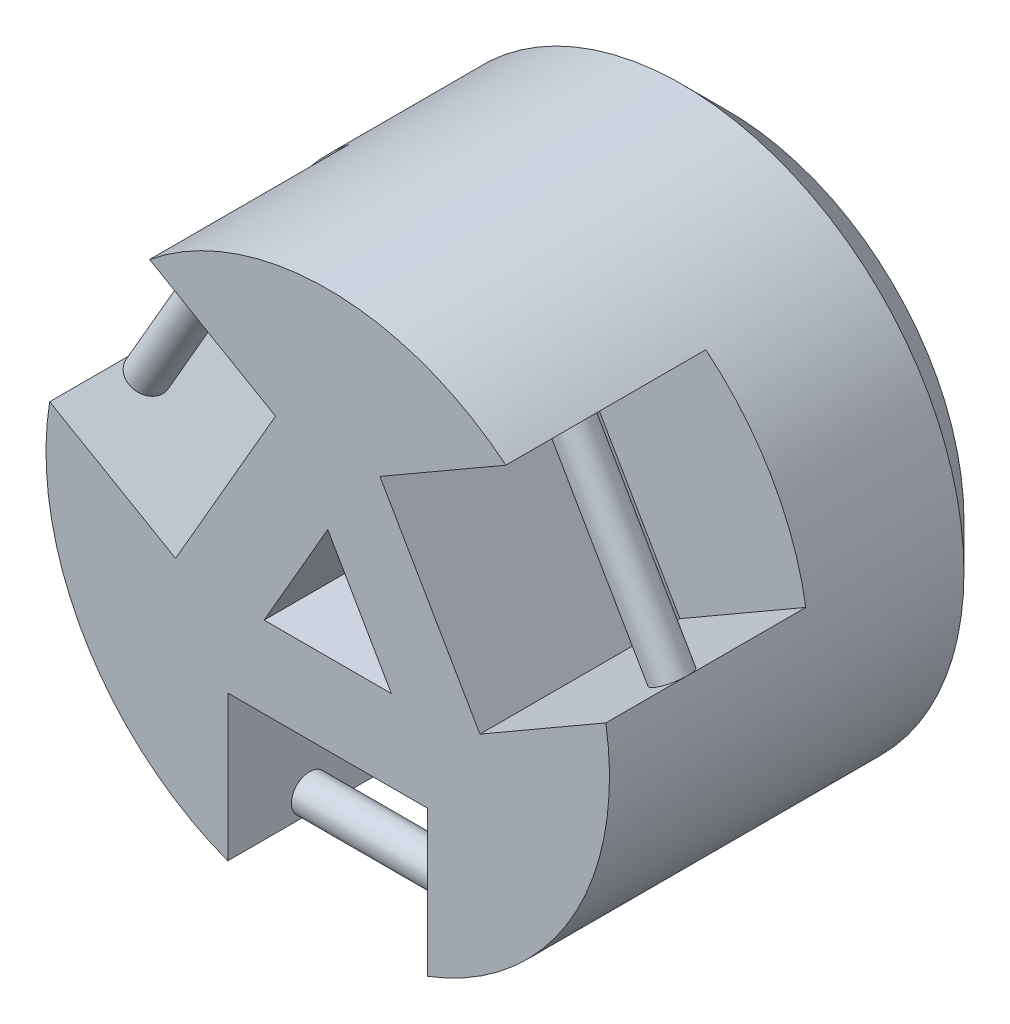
ISO-10303-21;
HEADER;
FILE_DESCRIPTION(('STEP AP214'),'2;1');
FILE_NAME('part.step','',(''),(''),'','','');
FILE_SCHEMA(('AUTOMOTIVE_DESIGN { 1 0 10303 214 1 1 1 1 }'));
ENDSEC;
DATA;
#1=APPLICATION_CONTEXT('core data for automotive mechanical design processes');
#2=APPLICATION_PROTOCOL_DEFINITION('international standard','automotive_design',2000,#1);
#3=PRODUCT_CONTEXT('',#1,'mechanical');
#4=PRODUCT('Part','Part','',(#3));
#5=PRODUCT_RELATED_PRODUCT_CATEGORY('part','',(#4));
#6=PRODUCT_DEFINITION_FORMATION('','',#4);
#7=PRODUCT_DEFINITION_CONTEXT('part definition',#1,'design');
#8=PRODUCT_DEFINITION('design','',#6,#7);
#9=PRODUCT_DEFINITION_SHAPE('','',#8);
#10=(LENGTH_UNIT() NAMED_UNIT(*) SI_UNIT(.MILLI.,.METRE.));
#11=(NAMED_UNIT(*) PLANE_ANGLE_UNIT() SI_UNIT($,.RADIAN.));
#12=(NAMED_UNIT(*) SI_UNIT($,.STERADIAN.) SOLID_ANGLE_UNIT());
#13=UNCERTAINTY_MEASURE_WITH_UNIT(LENGTH_MEASURE(1.E-05),#10,'distance_accuracy_value','');
#14=(GEOMETRIC_REPRESENTATION_CONTEXT(3) GLOBAL_UNCERTAINTY_ASSIGNED_CONTEXT((#13)) GLOBAL_UNIT_ASSIGNED_CONTEXT((#10,
#11,#12)) REPRESENTATION_CONTEXT('',''));
#15=CARTESIAN_POINT('',(0.,0.,0.));
#16=DIRECTION('',(0.,0.,1.));
#17=DIRECTION('',(1.,0.,0.));
#18=AXIS2_PLACEMENT_3D('',#15,#16,#17);
#19=CARTESIAN_POINT('',(0.,0.,22.));
#20=DIRECTION('',(0.,0.,-1.));
#21=DIRECTION('',(-1.,0.,0.));
#22=AXIS2_PLACEMENT_3D('',#19,#20,#21);
#23=CYLINDRICAL_SURFACE('',#22,15.5);
#24=CARTESIAN_POINT('',(0.,0.,2.5));
#25=DIRECTION('',(0.,0.,1.));
#26=DIRECTION('',(1.,0.,0.));
#27=AXIS2_PLACEMENT_3D('',#24,#25,#26);
#28=CIRCLE('',#27,15.5);
#29=CARTESIAN_POINT('',(15.5,0.,2.5));
#30=VERTEX_POINT('',#29);
#31=EDGE_CURVE('E235',#30,#30,#28,.T.);
#32=ORIENTED_EDGE('',*,*,#31,.T.);
#33=EDGE_LOOP('',(#32));
#34=FACE_BOUND('',#33,.T.);
#35=CARTESIAN_POINT('',(0.,0.,11.));
#36=DIRECTION('',(0.,0.,1.));
#37=DIRECTION('',(-0.499999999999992,0.866025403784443,0.));
#38=AXIS2_PLACEMENT_3D('',#35,#36,#37);
#39=CIRCLE('',#38,15.5);
#40=CARTESIAN_POINT('',(15.2999003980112,2.48254865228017,11.));
#41=VERTEX_POINT('',#40);
#42=CARTESIAN_POINT('',(9.79990039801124,12.008828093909,11.));
#43=VERTEX_POINT('',#42);
#44=EDGE_CURVE('E535',#41,#43,#39,.T.);
#45=ORIENTED_EDGE('',*,*,#44,.F.);
#46=DIRECTION('',(0.,0.,1.));
#47=VECTOR('',#46,1.);
#48=CARTESIAN_POINT('',(15.2999003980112,2.48254865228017,11.));
#49=LINE('',#48,#47);
#50=CARTESIAN_POINT('',(15.2999003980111,2.48254865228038,17.5));
#51=VERTEX_POINT('',#50);
#52=EDGE_CURVE('E554',#41,#51,#49,.T.);
#53=ORIENTED_EDGE('',*,*,#52,.T.);
#54=CARTESIAN_POINT('',(15.2999003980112,2.48254865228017,22.));
#55=VERTEX_POINT('',#54);
#56=EDGE_CURVE('E557',#51,#55,#49,.T.);
#57=ORIENTED_EDGE('',*,*,#56,.T.);
#58=CARTESIAN_POINT('',(0.,0.,22.));
#59=DIRECTION('',(0.,0.,1.));
#60=DIRECTION('',(1.,0.,0.));
#61=AXIS2_PLACEMENT_3D('',#58,#59,#60);
#62=CIRCLE('',#61,15.5);
#63=CARTESIAN_POINT('',(5.5,-14.4913767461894,22.));
#64=VERTEX_POINT('',#63);
#65=EDGE_CURVE('E232',#64,#55,#62,.T.);
#66=ORIENTED_EDGE('',*,*,#65,.F.);
#67=DIRECTION('',(0.,0.,1.));
#68=VECTOR('',#67,1.);
#69=CARTESIAN_POINT('',(5.5,-14.4913767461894,11.));
#70=LINE('',#69,#68);
#71=CARTESIAN_POINT('',(5.5,-14.4913767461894,17.5));
#72=VERTEX_POINT('',#71);
#73=EDGE_CURVE('E213',#72,#64,#70,.T.);
#74=ORIENTED_EDGE('',*,*,#73,.F.);
#75=CARTESIAN_POINT('',(5.5,-14.4913767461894,11.));
#76=VERTEX_POINT('',#75);
#77=EDGE_CURVE('E230',#76,#72,#70,.T.);
#78=ORIENTED_EDGE('',*,*,#77,.F.);
#79=CARTESIAN_POINT('',(0.,0.,11.));
#80=DIRECTION('',(0.,0.,1.));
#81=DIRECTION('',(1.,0.,0.));
#82=AXIS2_PLACEMENT_3D('',#79,#80,#81);
#83=CIRCLE('',#82,15.5);
#84=CARTESIAN_POINT('',(-5.5,-14.4913767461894,11.));
#85=VERTEX_POINT('',#84);
#86=EDGE_CURVE('E200',#85,#76,#83,.T.);
#87=ORIENTED_EDGE('',*,*,#86,.F.);
#88=DIRECTION('',(0.,0.,1.));
#89=VECTOR('',#88,1.);
#90=CARTESIAN_POINT('',(-5.5,-14.4913767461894,11.));
#91=LINE('',#90,#89);
#92=CARTESIAN_POINT('',(-5.5,-14.4913767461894,17.5));
#93=VERTEX_POINT('',#92);
#94=EDGE_CURVE('E223',#85,#93,#91,.T.);
#95=ORIENTED_EDGE('',*,*,#94,.T.);
#96=CARTESIAN_POINT('',(-5.5,-14.4913767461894,22.));
#97=VERTEX_POINT('',#96);
#98=EDGE_CURVE('E225',#93,#97,#91,.T.);
#99=ORIENTED_EDGE('',*,*,#98,.T.);
#100=CARTESIAN_POINT('',(-15.2999003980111,2.48254865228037,22.));
#101=VERTEX_POINT('',#100);
#102=EDGE_CURVE('E190',#101,#97,#62,.T.);
#103=ORIENTED_EDGE('',*,*,#102,.F.);
#104=DIRECTION('',(0.,0.,1.));
#105=VECTOR('',#104,1.);
#106=CARTESIAN_POINT('',(-15.2999003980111,2.48254865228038,11.));
#107=LINE('',#106,#105);
#108=CARTESIAN_POINT('',(-15.2999003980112,2.48254865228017,17.5));
#109=VERTEX_POINT('',#108);
#110=EDGE_CURVE('E185',#109,#101,#107,.T.);
#111=ORIENTED_EDGE('',*,*,#110,.F.);
#112=CARTESIAN_POINT('',(-15.2999003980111,2.48254865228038,11.));
#113=VERTEX_POINT('',#112);
#114=EDGE_CURVE('E174',#113,#109,#107,.T.);
#115=ORIENTED_EDGE('',*,*,#114,.F.);
#116=CARTESIAN_POINT('',(0.,0.,11.));
#117=DIRECTION('',(0.,0.,1.));
#118=DIRECTION('',(-0.500000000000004,-0.866025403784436,0.));
#119=AXIS2_PLACEMENT_3D('',#116,#117,#118);
#120=CIRCLE('',#119,15.5);
#121=CARTESIAN_POINT('',(-9.79990039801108,12.0088280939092,11.));
#122=VERTEX_POINT('',#121);
#123=EDGE_CURVE('E564',#122,#113,#120,.T.);
#124=ORIENTED_EDGE('',*,*,#123,.F.);
#125=DIRECTION('',(0.,0.,1.));
#126=VECTOR('',#125,1.);
#127=CARTESIAN_POINT('',(-9.79990039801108,12.0088280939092,11.));
#128=LINE('',#127,#126);
#129=CARTESIAN_POINT('',(-9.79990039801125,12.008828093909,17.5));
#130=VERTEX_POINT('',#129);
#131=EDGE_CURVE('E218',#122,#130,#128,.T.);
#132=ORIENTED_EDGE('',*,*,#131,.T.);
#133=CARTESIAN_POINT('',(-9.79990039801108,12.0088280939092,22.));
#134=VERTEX_POINT('',#133);
#135=EDGE_CURVE('E576',#130,#134,#128,.T.);
#136=ORIENTED_EDGE('',*,*,#135,.T.);
#137=CARTESIAN_POINT('',(9.79990039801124,12.008828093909,22.));
#138=VERTEX_POINT('',#137);
#139=EDGE_CURVE('E236',#138,#134,#62,.T.);
#140=ORIENTED_EDGE('',*,*,#139,.F.);
#141=DIRECTION('',(0.,0.,1.));
#142=VECTOR('',#141,1.);
#143=CARTESIAN_POINT('',(9.79990039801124,12.008828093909,11.));
#144=LINE('',#143,#142);
#145=CARTESIAN_POINT('',(9.79990039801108,12.0088280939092,17.5));
#146=VERTEX_POINT('',#145);
#147=EDGE_CURVE('E70',#146,#138,#144,.T.);
#148=ORIENTED_EDGE('',*,*,#147,.F.);
#149=EDGE_CURVE('E562',#43,#146,#144,.T.);
#150=ORIENTED_EDGE('',*,*,#149,.F.);
#151=EDGE_LOOP('',(#45,#53,#57,#66,#74,#78,#87,#95,#99,#103,#111,#115,#124,#132,#136,#140,#148,#150));
#152=FACE_BOUND('',#151,.T.);
#153=ADVANCED_FACE('F47',(#34,#152),#23,.T.);
#154=CARTESIAN_POINT('',(0.,0.,22.));
#155=DIRECTION('',(0.,0.,1.));
#156=DIRECTION('',(1.,0.,0.));
#157=AXIS2_PLACEMENT_3D('',#154,#155,#156);
#158=PLANE('',#157);
#159=DIRECTION('',(1.,0.,0.));
#160=VECTOR('',#159,1.);
#161=CARTESIAN_POINT('',(3.5,-2.02072594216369,22.));
#162=LINE('',#161,#160);
#163=CARTESIAN_POINT('',(-3.5,-2.02072594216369,22.));
#164=VERTEX_POINT('',#163);
#165=CARTESIAN_POINT('',(3.5,-2.02072594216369,22.));
#166=VERTEX_POINT('',#165);
#167=EDGE_CURVE('E62',#164,#166,#162,.T.);
#168=ORIENTED_EDGE('',*,*,#167,.F.);
#169=DIRECTION('',(-0.5,-0.866025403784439,0.));
#170=VECTOR('',#169,1.);
#171=CARTESIAN_POINT('',(-3.5,-2.02072594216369,22.));
#172=LINE('',#171,#170);
#173=CARTESIAN_POINT('',(0.,4.04145188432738,22.));
#174=VERTEX_POINT('',#173);
#175=EDGE_CURVE('E516',#174,#164,#172,.T.);
#176=ORIENTED_EDGE('',*,*,#175,.F.);
#177=DIRECTION('',(-0.5,0.866025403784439,0.));
#178=VECTOR('',#177,1.);
#179=CARTESIAN_POINT('',(0.,4.04145188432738,22.));
#180=LINE('',#179,#178);
#181=EDGE_CURVE('E524',#166,#174,#180,.T.);
#182=ORIENTED_EDGE('',*,*,#181,.F.);
#183=EDGE_LOOP('',(#168,#176,#182));
#184=FACE_BOUND('',#183,.T.);
#185=DIRECTION('',(0.866025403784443,0.499999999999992,0.));
#186=VECTOR('',#185,1.);
#187=CARTESIAN_POINT('',(8.37169716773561,-1.51745134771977,22.));
#188=LINE('',#187,#186);
#189=CARTESIAN_POINT('',(8.37169716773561,-1.51745134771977,22.));
#190=VERTEX_POINT('',#189);
#191=EDGE_CURVE('E539',#190,#55,#188,.T.);
#192=ORIENTED_EDGE('',*,*,#191,.F.);
#193=DIRECTION('',(0.499999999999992,-0.866025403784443,0.));
#194=VECTOR('',#193,1.);
#195=CARTESIAN_POINT('',(8.37169716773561,-1.51745134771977,22.));
#196=LINE('',#195,#194);
#197=CARTESIAN_POINT('',(2.8716971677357,8.00882809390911,22.));
#198=VERTEX_POINT('',#197);
#199=EDGE_CURVE('E549',#198,#190,#196,.T.);
#200=ORIENTED_EDGE('',*,*,#199,.F.);
#201=DIRECTION('',(-0.866025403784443,-0.499999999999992,0.));
#202=VECTOR('',#201,1.);
#203=CARTESIAN_POINT('',(2.8716971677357,8.00882809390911,22.));
#204=LINE('',#203,#202);
#205=EDGE_CURVE('E531',#138,#198,#204,.T.);
#206=ORIENTED_EDGE('',*,*,#205,.F.);
#207=ORIENTED_EDGE('',*,*,#139,.T.);
#208=DIRECTION('',(-0.866025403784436,0.500000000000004,0.));
#209=VECTOR('',#208,1.);
#210=CARTESIAN_POINT('',(-2.87169716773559,8.00882809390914,22.));
#211=LINE('',#210,#209);
#212=CARTESIAN_POINT('',(-2.87169716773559,8.00882809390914,22.));
#213=VERTEX_POINT('',#212);
#214=EDGE_CURVE('E566',#213,#134,#211,.T.);
#215=ORIENTED_EDGE('',*,*,#214,.F.);
#216=DIRECTION('',(0.500000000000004,0.866025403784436,0.));
#217=VECTOR('',#216,1.);
#218=CARTESIAN_POINT('',(-2.87169716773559,8.00882809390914,22.));
#219=LINE('',#218,#217);
#220=CARTESIAN_POINT('',(-8.37169716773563,-1.51745134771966,22.));
#221=VERTEX_POINT('',#220);
#222=EDGE_CURVE('E571',#221,#213,#219,.T.);
#223=ORIENTED_EDGE('',*,*,#222,.F.);
#224=DIRECTION('',(0.866025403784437,-0.500000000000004,0.));
#225=VECTOR('',#224,1.);
#226=CARTESIAN_POINT('',(-8.37169716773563,-1.51745134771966,22.));
#227=LINE('',#226,#225);
#228=EDGE_CURVE('E556',#101,#221,#227,.T.);
#229=ORIENTED_EDGE('',*,*,#228,.F.);
#230=ORIENTED_EDGE('',*,*,#102,.T.);
#231=DIRECTION('',(0.,-1.,0.));
#232=VECTOR('',#231,1.);
#233=CARTESIAN_POINT('',(-5.5,-6.49137674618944,22.));
#234=LINE('',#233,#232);
#235=CARTESIAN_POINT('',(-5.5,-6.49137674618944,22.));
#236=VERTEX_POINT('',#235);
#237=EDGE_CURVE('E204',#236,#97,#234,.T.);
#238=ORIENTED_EDGE('',*,*,#237,.F.);
#239=DIRECTION('',(-1.,0.,0.));
#240=VECTOR('',#239,1.);
#241=CARTESIAN_POINT('',(-5.5,-6.49137674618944,22.));
#242=LINE('',#241,#240);
#243=CARTESIAN_POINT('',(5.5,-6.49137674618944,22.));
#244=VERTEX_POINT('',#243);
#245=EDGE_CURVE('E217',#244,#236,#242,.T.);
#246=ORIENTED_EDGE('',*,*,#245,.F.);
#247=DIRECTION('',(0.,1.,0.));
#248=VECTOR('',#247,1.);
#249=CARTESIAN_POINT('',(5.5,-6.49137674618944,22.));
#250=LINE('',#249,#248);
#251=EDGE_CURVE('E214',#64,#244,#250,.T.);
#252=ORIENTED_EDGE('',*,*,#251,.F.);
#253=ORIENTED_EDGE('',*,*,#65,.T.);
#254=EDGE_LOOP('',(#192,#200,#206,#207,#215,#223,#229,#230,#238,#246,#252,#253));
#255=FACE_BOUND('',#254,.T.);
#256=ADVANCED_FACE('F264',(#184,#255),#158,.T.);
#257=CARTESIAN_POINT('',(0.,0.,0.));
#258=DIRECTION('',(0.,0.,1.));
#259=DIRECTION('',(1.,0.,0.));
#260=AXIS2_PLACEMENT_3D('',#257,#258,#259);
#261=PLANE('',#260);
#262=CARTESIAN_POINT('',(0.,0.,0.));
#263=DIRECTION('',(0.,0.,1.));
#264=DIRECTION('',(1.,0.,0.));
#265=AXIS2_PLACEMENT_3D('',#262,#263,#264);
#266=CIRCLE('',#265,3.);
#267=CARTESIAN_POINT('',(3.,0.,0.));
#268=VERTEX_POINT('',#267);
#269=EDGE_CURVE('E242',#268,#268,#266,.F.);
#270=ORIENTED_EDGE('',*,*,#269,.F.);
#271=EDGE_LOOP('',(#270));
#272=FACE_BOUND('',#271,.T.);
#273=CARTESIAN_POINT('',(0.,0.,0.));
#274=DIRECTION('',(0.,0.,1.));
#275=DIRECTION('',(1.,0.,0.));
#276=AXIS2_PLACEMENT_3D('',#273,#274,#275);
#277=CIRCLE('',#276,13.);
#278=CARTESIAN_POINT('',(13.,0.,0.));
#279=VERTEX_POINT('',#278);
#280=EDGE_CURVE('E239',#279,#279,#277,.F.);
#281=ORIENTED_EDGE('',*,*,#280,.T.);
#282=EDGE_LOOP('',(#281));
#283=FACE_BOUND('',#282,.T.);
#284=ADVANCED_FACE('F272',(#272,#283),#261,.F.);
#285=CARTESIAN_POINT('',(0.,0.,2.5));
#286=DIRECTION('',(0.,0.,1.));
#287=DIRECTION('',(1.,0.,0.));
#288=AXIS2_PLACEMENT_3D('',#285,#286,#287);
#289=CONICAL_SURFACE('',#288,15.5,0.785398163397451);
#290=ORIENTED_EDGE('',*,*,#280,.F.);
#291=EDGE_LOOP('',(#290));
#292=FACE_BOUND('',#291,.T.);
#293=ORIENTED_EDGE('',*,*,#31,.F.);
#294=EDGE_LOOP('',(#293));
#295=FACE_BOUND('',#294,.T.);
#296=ADVANCED_FACE('F276',(#292,#295),#289,.T.);
#297=CARTESIAN_POINT('',(0.,0.,-5.));
#298=DIRECTION('',(0.,0.,1.));
#299=DIRECTION('',(1.,0.,0.));
#300=AXIS2_PLACEMENT_3D('',#297,#298,#299);
#301=CYLINDRICAL_SURFACE('',#300,3.);
#302=CARTESIAN_POINT('',(0.,0.,-4.));
#303=DIRECTION('',(0.,0.,-1.));
#304=DIRECTION('',(-1.,0.,0.));
#305=AXIS2_PLACEMENT_3D('',#302,#303,#304);
#306=CIRCLE('',#305,3.);
#307=CARTESIAN_POINT('',(-3.,0.,-4.));
#308=VERTEX_POINT('',#307);
#309=EDGE_CURVE('E13',#308,#308,#306,.F.);
#310=ORIENTED_EDGE('',*,*,#309,.T.);
#311=EDGE_LOOP('',(#310));
#312=FACE_BOUND('',#311,.T.);
#313=ORIENTED_EDGE('',*,*,#269,.T.);
#314=EDGE_LOOP('',(#313));
#315=FACE_BOUND('',#314,.T.);
#316=ADVANCED_FACE('F260',(#312,#315),#301,.T.);
#317=CARTESIAN_POINT('',(0.,0.,-5.));
#318=DIRECTION('',(0.,0.,-1.));
#319=DIRECTION('',(-1.,0.,0.));
#320=AXIS2_PLACEMENT_3D('',#317,#318,#319);
#321=PLANE('',#320);
#322=CARTESIAN_POINT('',(0.,0.,-5.));
#323=DIRECTION('',(0.,0.,-1.));
#324=DIRECTION('',(-1.,0.,0.));
#325=AXIS2_PLACEMENT_3D('',#322,#323,#324);
#326=CIRCLE('',#325,2.00000000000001);
#327=CARTESIAN_POINT('',(-2.00000000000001,0.,-5.));
#328=VERTEX_POINT('',#327);
#329=EDGE_CURVE('E55',#328,#328,#326,.T.);
#330=ORIENTED_EDGE('',*,*,#329,.T.);
#331=EDGE_LOOP('',(#330));
#332=FACE_BOUND('',#331,.T.);
#333=ADVANCED_FACE('F247',(#332),#321,.T.);
#334=CARTESIAN_POINT('',(0.,0.,-5.));
#335=DIRECTION('',(0.,0.,1.));
#336=DIRECTION('',(1.,0.,0.));
#337=AXIS2_PLACEMENT_3D('',#334,#335,#336);
#338=CONICAL_SURFACE('',#337,2.00000000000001,0.785398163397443);
#339=ORIENTED_EDGE('',*,*,#309,.F.);
#340=EDGE_LOOP('',(#339));
#341=FACE_BOUND('',#340,.T.);
#342=ORIENTED_EDGE('',*,*,#329,.F.);
#343=EDGE_LOOP('',(#342));
#344=FACE_BOUND('',#343,.T.);
#345=ADVANCED_FACE('F49',(#341,#344),#338,.T.);
#346=CARTESIAN_POINT('',(-5.5,-6.49137674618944,11.));
#347=DIRECTION('',(-1.,0.,0.));
#348=DIRECTION('',(0.,-1.,0.));
#349=AXIS2_PLACEMENT_3D('',#346,#347,#348);
#350=PLANE('',#349);
#351=ORIENTED_EDGE('',*,*,#98,.F.);
#352=CARTESIAN_POINT('',(-5.5,-13.4913767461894,17.5));
#353=DIRECTION('',(1.,0.,0.));
#354=DIRECTION('',(0.,0.,-1.));
#355=AXIS2_PLACEMENT_3D('',#352,#353,#354);
#356=CIRCLE('',#355,1.);
#357=EDGE_CURVE('E504',#93,#93,#356,.T.);
#358=ORIENTED_EDGE('',*,*,#357,.F.);
#359=ORIENTED_EDGE('',*,*,#94,.F.);
#360=DIRECTION('',(0.,-1.,0.));
#361=VECTOR('',#360,1.);
#362=CARTESIAN_POINT('',(-5.5,-6.49137674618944,11.));
#363=LINE('',#362,#361);
#364=CARTESIAN_POINT('',(-5.5,-6.49137674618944,11.));
#365=VERTEX_POINT('',#364);
#366=EDGE_CURVE('E210',#365,#85,#363,.T.);
#367=ORIENTED_EDGE('',*,*,#366,.F.);
#368=DIRECTION('',(0.,0.,1.));
#369=VECTOR('',#368,1.);
#370=CARTESIAN_POINT('',(-5.5,-6.49137674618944,11.));
#371=LINE('',#370,#369);
#372=EDGE_CURVE('E226',#365,#236,#371,.T.);
#373=ORIENTED_EDGE('',*,*,#372,.T.);
#374=ORIENTED_EDGE('',*,*,#237,.T.);
#375=EDGE_LOOP('',(#351,#358,#359,#367,#373,#374));
#376=FACE_BOUND('',#375,.T.);
#377=ADVANCED_FACE('F250',(#376),#350,.F.);
#378=CARTESIAN_POINT('',(-5.5,-6.49137674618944,11.));
#379=DIRECTION('',(0.,1.,0.));
#380=DIRECTION('',(0.,0.,1.));
#381=AXIS2_PLACEMENT_3D('',#378,#379,#380);
#382=PLANE('',#381);
#383=ORIENTED_EDGE('',*,*,#245,.T.);
#384=ORIENTED_EDGE('',*,*,#372,.F.);
#385=DIRECTION('',(-1.,0.,0.));
#386=VECTOR('',#385,1.);
#387=CARTESIAN_POINT('',(-5.5,-6.49137674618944,11.));
#388=LINE('',#387,#386);
#389=CARTESIAN_POINT('',(5.5,-6.49137674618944,11.));
#390=VERTEX_POINT('',#389);
#391=EDGE_CURVE('E207',#390,#365,#388,.T.);
#392=ORIENTED_EDGE('',*,*,#391,.F.);
#393=DIRECTION('',(0.,0.,1.));
#394=VECTOR('',#393,1.);
#395=CARTESIAN_POINT('',(5.5,-6.49137674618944,11.));
#396=LINE('',#395,#394);
#397=EDGE_CURVE('E228',#390,#244,#396,.T.);
#398=ORIENTED_EDGE('',*,*,#397,.T.);
#399=EDGE_LOOP('',(#383,#384,#392,#398));
#400=FACE_BOUND('',#399,.T.);
#401=ADVANCED_FACE('F257',(#400),#382,.F.);
#402=CARTESIAN_POINT('',(5.5,-6.49137674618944,11.));
#403=DIRECTION('',(1.,0.,0.));
#404=DIRECTION('',(0.,1.,0.));
#405=AXIS2_PLACEMENT_3D('',#402,#403,#404);
#406=PLANE('',#405);
#407=ORIENTED_EDGE('',*,*,#77,.T.);
#408=CARTESIAN_POINT('',(5.5,-13.4913767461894,17.5));
#409=DIRECTION('',(1.,0.,0.));
#410=DIRECTION('',(0.,0.,-1.));
#411=AXIS2_PLACEMENT_3D('',#408,#409,#410);
#412=CIRCLE('',#411,1.);
#413=EDGE_CURVE('E507',#72,#72,#412,.T.);
#414=ORIENTED_EDGE('',*,*,#413,.T.);
#415=ORIENTED_EDGE('',*,*,#73,.T.);
#416=ORIENTED_EDGE('',*,*,#251,.T.);
#417=ORIENTED_EDGE('',*,*,#397,.F.);
#418=DIRECTION('',(0.,1.,0.));
#419=VECTOR('',#418,1.);
#420=CARTESIAN_POINT('',(5.5,-6.49137674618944,11.));
#421=LINE('',#420,#419);
#422=EDGE_CURVE('E203',#76,#390,#421,.T.);
#423=ORIENTED_EDGE('',*,*,#422,.F.);
#424=EDGE_LOOP('',(#407,#414,#415,#416,#417,#423));
#425=FACE_BOUND('',#424,.T.);
#426=ADVANCED_FACE('F338',(#425),#406,.F.);
#427=CARTESIAN_POINT('',(0.,0.,11.));
#428=DIRECTION('',(0.,0.,1.));
#429=DIRECTION('',(1.,0.,0.));
#430=AXIS2_PLACEMENT_3D('',#427,#428,#429);
#431=PLANE('',#430);
#432=ORIENTED_EDGE('',*,*,#86,.T.);
#433=ORIENTED_EDGE('',*,*,#422,.T.);
#434=ORIENTED_EDGE('',*,*,#391,.T.);
#435=ORIENTED_EDGE('',*,*,#366,.T.);
#436=EDGE_LOOP('',(#432,#433,#434,#435));
#437=FACE_BOUND('',#436,.T.);
#438=ADVANCED_FACE('F348',(#437),#431,.T.);
#439=CARTESIAN_POINT('',(-2.87169716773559,8.00882809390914,11.));
#440=DIRECTION('',(0.500000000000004,0.866025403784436,0.));
#441=DIRECTION('',(-0.866025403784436,0.500000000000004,0.));
#442=AXIS2_PLACEMENT_3D('',#439,#440,#441);
#443=PLANE('',#442);
#444=ORIENTED_EDGE('',*,*,#135,.F.);
#445=CARTESIAN_POINT('',(-8.9338749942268,11.508828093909,17.5));
#446=DIRECTION('',(-0.499999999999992,-0.866025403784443,0.));
#447=DIRECTION('',(0.,0.,-1.));
#448=AXIS2_PLACEMENT_3D('',#445,#446,#447);
#449=CIRCLE('',#448,1.);
#450=EDGE_CURVE('E496',#130,#130,#449,.T.);
#451=ORIENTED_EDGE('',*,*,#450,.F.);
#452=ORIENTED_EDGE('',*,*,#131,.F.);
#453=DIRECTION('',(-0.866025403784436,0.500000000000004,0.));
#454=VECTOR('',#453,1.);
#455=CARTESIAN_POINT('',(-2.87169716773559,8.00882809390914,11.));
#456=LINE('',#455,#454);
#457=CARTESIAN_POINT('',(-2.87169716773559,8.00882809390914,11.));
#458=VERTEX_POINT('',#457);
#459=EDGE_CURVE('E193',#458,#122,#456,.T.);
#460=ORIENTED_EDGE('',*,*,#459,.F.);
#461=DIRECTION('',(0.,0.,1.));
#462=VECTOR('',#461,1.);
#463=CARTESIAN_POINT('',(-2.87169716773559,8.00882809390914,11.));
#464=LINE('',#463,#462);
#465=EDGE_CURVE('E577',#458,#213,#464,.T.);
#466=ORIENTED_EDGE('',*,*,#465,.T.);
#467=ORIENTED_EDGE('',*,*,#214,.T.);
#468=EDGE_LOOP('',(#444,#451,#452,#460,#466,#467));
#469=FACE_BOUND('',#468,.T.);
#470=ADVANCED_FACE('F356',(#469),#443,.F.);
#471=CARTESIAN_POINT('',(-2.87169716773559,8.00882809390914,11.));
#472=DIRECTION('',(0.866025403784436,-0.500000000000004,0.));
#473=DIRECTION('',(0.500000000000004,0.866025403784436,0.));
#474=AXIS2_PLACEMENT_3D('',#471,#472,#473);
#475=PLANE('',#474);
#476=ORIENTED_EDGE('',*,*,#222,.T.);
#477=ORIENTED_EDGE('',*,*,#465,.F.);
#478=DIRECTION('',(0.500000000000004,0.866025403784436,0.));
#479=VECTOR('',#478,1.);
#480=CARTESIAN_POINT('',(-2.87169716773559,8.00882809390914,11.));
#481=LINE('',#480,#479);
#482=CARTESIAN_POINT('',(-8.37169716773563,-1.51745134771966,11.));
#483=VERTEX_POINT('',#482);
#484=EDGE_CURVE('E195',#483,#458,#481,.T.);
#485=ORIENTED_EDGE('',*,*,#484,.F.);
#486=DIRECTION('',(0.,0.,1.));
#487=VECTOR('',#486,1.);
#488=CARTESIAN_POINT('',(-8.37169716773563,-1.51745134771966,11.));
#489=LINE('',#488,#487);
#490=EDGE_CURVE('E184',#483,#221,#489,.T.);
#491=ORIENTED_EDGE('',*,*,#490,.T.);
#492=EDGE_LOOP('',(#476,#477,#485,#491));
#493=FACE_BOUND('',#492,.T.);
#494=ADVANCED_FACE('F365',(#493),#475,.F.);
#495=CARTESIAN_POINT('',(-8.37169716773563,-1.51745134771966,11.));
#496=DIRECTION('',(-0.500000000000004,-0.866025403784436,0.));
#497=DIRECTION('',(0.866025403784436,-0.500000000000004,0.));
#498=AXIS2_PLACEMENT_3D('',#495,#496,#497);
#499=PLANE('',#498);
#500=ORIENTED_EDGE('',*,*,#114,.T.);
#501=CARTESIAN_POINT('',(-14.4338749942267,1.98254865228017,17.5));
#502=DIRECTION('',(-0.499999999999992,-0.866025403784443,0.));
#503=DIRECTION('',(0.,0.,-1.));
#504=AXIS2_PLACEMENT_3D('',#501,#502,#503);
#505=CIRCLE('',#504,1.);
#506=EDGE_CURVE('E178',#109,#109,#505,.T.);
#507=ORIENTED_EDGE('',*,*,#506,.T.);
#508=ORIENTED_EDGE('',*,*,#110,.T.);
#509=ORIENTED_EDGE('',*,*,#228,.T.);
#510=ORIENTED_EDGE('',*,*,#490,.F.);
#511=DIRECTION('',(0.866025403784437,-0.500000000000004,0.));
#512=VECTOR('',#511,1.);
#513=CARTESIAN_POINT('',(-8.37169716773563,-1.51745134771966,11.));
#514=LINE('',#513,#512);
#515=EDGE_CURVE('E180',#113,#483,#514,.T.);
#516=ORIENTED_EDGE('',*,*,#515,.F.);
#517=EDGE_LOOP('',(#500,#507,#508,#509,#510,#516));
#518=FACE_BOUND('',#517,.T.);
#519=ADVANCED_FACE('F176',(#518),#499,.F.);
#520=CARTESIAN_POINT('',(0.,0.,11.));
#521=DIRECTION('',(0.,0.,1.));
#522=DIRECTION('',(-0.500000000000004,-0.866025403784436,0.));
#523=AXIS2_PLACEMENT_3D('',#520,#521,#522);
#524=PLANE('',#523);
#525=ORIENTED_EDGE('',*,*,#123,.T.);
#526=ORIENTED_EDGE('',*,*,#515,.T.);
#527=ORIENTED_EDGE('',*,*,#484,.T.);
#528=ORIENTED_EDGE('',*,*,#459,.T.);
#529=EDGE_LOOP('',(#525,#526,#527,#528));
#530=FACE_BOUND('',#529,.T.);
#531=ADVANCED_FACE('F382',(#530),#524,.T.);
#532=CARTESIAN_POINT('',(8.37169716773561,-1.51745134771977,11.));
#533=DIRECTION('',(0.499999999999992,-0.866025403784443,0.));
#534=DIRECTION('',(0.866025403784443,0.499999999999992,0.));
#535=AXIS2_PLACEMENT_3D('',#532,#533,#534);
#536=PLANE('',#535);
#537=ORIENTED_EDGE('',*,*,#56,.F.);
#538=CARTESIAN_POINT('',(14.4338749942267,1.98254865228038,17.5));
#539=DIRECTION('',(-0.500000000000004,0.866025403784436,0.));
#540=DIRECTION('',(0.,0.,-1.));
#541=AXIS2_PLACEMENT_3D('',#538,#539,#540);
#542=CIRCLE('',#541,1.);
#543=EDGE_CURVE('E499',#51,#51,#542,.T.);
#544=ORIENTED_EDGE('',*,*,#543,.F.);
#545=ORIENTED_EDGE('',*,*,#52,.F.);
#546=DIRECTION('',(0.866025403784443,0.499999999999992,0.));
#547=VECTOR('',#546,1.);
#548=CARTESIAN_POINT('',(8.37169716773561,-1.51745134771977,11.));
#549=LINE('',#548,#547);
#550=CARTESIAN_POINT('',(8.37169716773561,-1.51745134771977,11.));
#551=VERTEX_POINT('',#550);
#552=EDGE_CURVE('E545',#551,#41,#549,.T.);
#553=ORIENTED_EDGE('',*,*,#552,.F.);
#554=DIRECTION('',(0.,0.,1.));
#555=VECTOR('',#554,1.);
#556=CARTESIAN_POINT('',(8.37169716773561,-1.51745134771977,11.));
#557=LINE('',#556,#555);
#558=EDGE_CURVE('E558',#551,#190,#557,.T.);
#559=ORIENTED_EDGE('',*,*,#558,.T.);
#560=ORIENTED_EDGE('',*,*,#191,.T.);
#561=EDGE_LOOP('',(#537,#544,#545,#553,#559,#560));
#562=FACE_BOUND('',#561,.T.);
#563=ADVANCED_FACE('F389',(#562),#536,.F.);
#564=CARTESIAN_POINT('',(8.37169716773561,-1.51745134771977,11.));
#565=DIRECTION('',(-0.866025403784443,-0.499999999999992,0.));
#566=DIRECTION('',(0.499999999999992,-0.866025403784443,0.));
#567=AXIS2_PLACEMENT_3D('',#564,#565,#566);
#568=PLANE('',#567);
#569=ORIENTED_EDGE('',*,*,#199,.T.);
#570=ORIENTED_EDGE('',*,*,#558,.F.);
#571=DIRECTION('',(0.499999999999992,-0.866025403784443,0.));
#572=VECTOR('',#571,1.);
#573=CARTESIAN_POINT('',(8.37169716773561,-1.51745134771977,11.));
#574=LINE('',#573,#572);
#575=CARTESIAN_POINT('',(2.8716971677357,8.00882809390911,11.));
#576=VERTEX_POINT('',#575);
#577=EDGE_CURVE('E542',#576,#551,#574,.T.);
#578=ORIENTED_EDGE('',*,*,#577,.F.);
#579=DIRECTION('',(0.,0.,1.));
#580=VECTOR('',#579,1.);
#581=CARTESIAN_POINT('',(2.8716971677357,8.00882809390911,11.));
#582=LINE('',#581,#580);
#583=EDGE_CURVE('E560',#576,#198,#582,.T.);
#584=ORIENTED_EDGE('',*,*,#583,.T.);
#585=EDGE_LOOP('',(#569,#570,#578,#584));
#586=FACE_BOUND('',#585,.T.);
#587=ADVANCED_FACE('F399',(#586),#568,.F.);
#588=CARTESIAN_POINT('',(2.8716971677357,8.00882809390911,11.));
#589=DIRECTION('',(-0.499999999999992,0.866025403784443,0.));
#590=DIRECTION('',(-0.866025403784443,-0.499999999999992,0.));
#591=AXIS2_PLACEMENT_3D('',#588,#589,#590);
#592=PLANE('',#591);
#593=ORIENTED_EDGE('',*,*,#149,.T.);
#594=CARTESIAN_POINT('',(8.93387499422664,11.5088280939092,17.5));
#595=DIRECTION('',(-0.500000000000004,0.866025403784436,0.));
#596=DIRECTION('',(0.,0.,-1.));
#597=AXIS2_PLACEMENT_3D('',#594,#595,#596);
#598=CIRCLE('',#597,1.);
#599=EDGE_CURVE('E502',#146,#146,#598,.T.);
#600=ORIENTED_EDGE('',*,*,#599,.T.);
#601=ORIENTED_EDGE('',*,*,#147,.T.);
#602=ORIENTED_EDGE('',*,*,#205,.T.);
#603=ORIENTED_EDGE('',*,*,#583,.F.);
#604=DIRECTION('',(-0.866025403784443,-0.499999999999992,0.));
#605=VECTOR('',#604,1.);
#606=CARTESIAN_POINT('',(2.8716971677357,8.00882809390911,11.));
#607=LINE('',#606,#605);
#608=EDGE_CURVE('E538',#43,#576,#607,.T.);
#609=ORIENTED_EDGE('',*,*,#608,.F.);
#610=EDGE_LOOP('',(#593,#600,#601,#602,#603,#609));
#611=FACE_BOUND('',#610,.T.);
#612=ADVANCED_FACE('F407',(#611),#592,.F.);
#613=CARTESIAN_POINT('',(0.,0.,11.));
#614=DIRECTION('',(0.,0.,1.));
#615=DIRECTION('',(-0.499999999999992,0.866025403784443,0.));
#616=AXIS2_PLACEMENT_3D('',#613,#614,#615);
#617=PLANE('',#616);
#618=ORIENTED_EDGE('',*,*,#44,.T.);
#619=ORIENTED_EDGE('',*,*,#608,.T.);
#620=ORIENTED_EDGE('',*,*,#577,.T.);
#621=ORIENTED_EDGE('',*,*,#552,.T.);
#622=EDGE_LOOP('',(#618,#619,#620,#621));
#623=FACE_BOUND('',#622,.T.);
#624=ADVANCED_FACE('F416',(#623),#617,.T.);
#625=CARTESIAN_POINT('',(3.5,-2.02072594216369,1.));
#626=DIRECTION('',(0.,-1.,0.));
#627=DIRECTION('',(1.,0.,0.));
#628=AXIS2_PLACEMENT_3D('',#625,#626,#627);
#629=PLANE('',#628);
#630=ORIENTED_EDGE('',*,*,#167,.T.);
#631=DIRECTION('',(0.,0.,1.));
#632=VECTOR('',#631,1.);
#633=CARTESIAN_POINT('',(3.5,-2.02072594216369,1.));
#634=LINE('',#633,#632);
#635=CARTESIAN_POINT('',(3.5,-2.02072594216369,1.));
#636=VERTEX_POINT('',#635);
#637=EDGE_CURVE('E522',#636,#166,#634,.T.);
#638=ORIENTED_EDGE('',*,*,#637,.F.);
#639=DIRECTION('',(1.,0.,0.));
#640=VECTOR('',#639,1.);
#641=CARTESIAN_POINT('',(3.5,-2.02072594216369,1.));
#642=LINE('',#641,#640);
#643=CARTESIAN_POINT('',(-3.5,-2.02072594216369,1.));
#644=VERTEX_POINT('',#643);
#645=EDGE_CURVE('E512',#644,#636,#642,.T.);
#646=ORIENTED_EDGE('',*,*,#645,.F.);
#647=DIRECTION('',(0.,0.,1.));
#648=VECTOR('',#647,1.);
#649=CARTESIAN_POINT('',(-3.5,-2.02072594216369,1.));
#650=LINE('',#649,#648);
#651=EDGE_CURVE('E529',#644,#164,#650,.T.);
#652=ORIENTED_EDGE('',*,*,#651,.T.);
#653=EDGE_LOOP('',(#630,#638,#646,#652));
#654=FACE_BOUND('',#653,.T.);
#655=ADVANCED_FACE('F423',(#654),#629,.F.);
#656=CARTESIAN_POINT('',(-3.5,-2.02072594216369,1.));
#657=DIRECTION('',(-0.866025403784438,0.5,0.));
#658=DIRECTION('',(-0.5,-0.866025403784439,0.));
#659=AXIS2_PLACEMENT_3D('',#656,#657,#658);
#660=PLANE('',#659);
#661=ORIENTED_EDGE('',*,*,#175,.T.);
#662=ORIENTED_EDGE('',*,*,#651,.F.);
#663=DIRECTION('',(-0.5,-0.866025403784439,0.));
#664=VECTOR('',#663,1.);
#665=CARTESIAN_POINT('',(-3.5,-2.02072594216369,1.));
#666=LINE('',#665,#664);
#667=CARTESIAN_POINT('',(0.,4.04145188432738,1.));
#668=VERTEX_POINT('',#667);
#669=EDGE_CURVE('E519',#668,#644,#666,.T.);
#670=ORIENTED_EDGE('',*,*,#669,.F.);
#671=DIRECTION('',(0.,0.,1.));
#672=VECTOR('',#671,1.);
#673=CARTESIAN_POINT('',(0.,4.04145188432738,1.));
#674=LINE('',#673,#672);
#675=EDGE_CURVE('E532',#668,#174,#674,.T.);
#676=ORIENTED_EDGE('',*,*,#675,.T.);
#677=EDGE_LOOP('',(#661,#662,#670,#676));
#678=FACE_BOUND('',#677,.T.);
#679=ADVANCED_FACE('F431',(#678),#660,.F.);
#680=CARTESIAN_POINT('',(0.,4.04145188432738,1.));
#681=DIRECTION('',(0.866025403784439,0.5,0.));
#682=DIRECTION('',(-0.5,0.866025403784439,0.));
#683=AXIS2_PLACEMENT_3D('',#680,#681,#682);
#684=PLANE('',#683);
#685=ORIENTED_EDGE('',*,*,#181,.T.);
#686=ORIENTED_EDGE('',*,*,#675,.F.);
#687=DIRECTION('',(-0.5,0.866025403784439,0.));
#688=VECTOR('',#687,1.);
#689=CARTESIAN_POINT('',(0.,4.04145188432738,1.));
#690=LINE('',#689,#688);
#691=EDGE_CURVE('E515',#636,#668,#690,.T.);
#692=ORIENTED_EDGE('',*,*,#691,.F.);
#693=ORIENTED_EDGE('',*,*,#637,.T.);
#694=EDGE_LOOP('',(#685,#686,#692,#693));
#695=FACE_BOUND('',#694,.T.);
#696=ADVANCED_FACE('F439',(#695),#684,.F.);
#697=CARTESIAN_POINT('',(0.,0.,1.));
#698=DIRECTION('',(0.,0.,-1.));
#699=DIRECTION('',(-1.,0.,0.));
#700=AXIS2_PLACEMENT_3D('',#697,#698,#699);
#701=PLANE('',#700);
#702=ORIENTED_EDGE('',*,*,#645,.T.);
#703=ORIENTED_EDGE('',*,*,#691,.T.);
#704=ORIENTED_EDGE('',*,*,#669,.T.);
#705=EDGE_LOOP('',(#702,#703,#704));
#706=FACE_BOUND('',#705,.T.);
#707=ADVANCED_FACE('F448',(#706),#701,.F.);
#708=CARTESIAN_POINT('',(5.5,-13.4913767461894,17.5));
#709=DIRECTION('',(-1.,0.,0.));
#710=DIRECTION('',(0.,0.,1.));
#711=AXIS2_PLACEMENT_3D('',#708,#709,#710);
#712=CYLINDRICAL_SURFACE('',#711,1.);
#713=ORIENTED_EDGE('',*,*,#413,.F.);
#714=EDGE_LOOP('',(#713));
#715=FACE_BOUND('',#714,.T.);
#716=ORIENTED_EDGE('',*,*,#357,.T.);
#717=EDGE_LOOP('',(#716));
#718=FACE_BOUND('',#717,.T.);
#719=ADVANCED_FACE('F457',(#715,#718),#712,.T.);
#720=CARTESIAN_POINT('',(8.93387499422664,11.5088280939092,17.5));
#721=DIRECTION('',(0.500000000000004,-0.866025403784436,0.));
#722=DIRECTION('',(0.866025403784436,0.500000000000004,0.));
#723=AXIS2_PLACEMENT_3D('',#720,#721,#722);
#724=CYLINDRICAL_SURFACE('',#723,1.);
#725=ORIENTED_EDGE('',*,*,#599,.F.);
#726=EDGE_LOOP('',(#725));
#727=FACE_BOUND('',#726,.T.);
#728=ORIENTED_EDGE('',*,*,#543,.T.);
#729=EDGE_LOOP('',(#728));
#730=FACE_BOUND('',#729,.T.);
#731=ADVANCED_FACE('F465',(#727,#730),#724,.T.);
#732=CARTESIAN_POINT('',(-14.4338749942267,1.98254865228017,17.5));
#733=DIRECTION('',(0.499999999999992,0.866025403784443,0.));
#734=DIRECTION('',(-0.866025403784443,0.499999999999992,0.));
#735=AXIS2_PLACEMENT_3D('',#732,#733,#734);
#736=CYLINDRICAL_SURFACE('',#735,1.);
#737=ORIENTED_EDGE('',*,*,#506,.F.);
#738=EDGE_LOOP('',(#737));
#739=FACE_BOUND('',#738,.T.);
#740=ORIENTED_EDGE('',*,*,#450,.T.);
#741=EDGE_LOOP('',(#740));
#742=FACE_BOUND('',#741,.T.);
#743=ADVANCED_FACE('F474',(#739,#742),#736,.T.);
#744=CLOSED_SHELL('',(#153,#256,#284,#296,#316,#333,#345,#377,#401,#426,#438,#470,#494,#519,
#531,#563,#587,#612,#624,#655,#679,#696,#707,#719,#731,#743));
#745=MANIFOLD_SOLID_BREP('B2',#744);
#746=ADVANCED_BREP_SHAPE_REPRESENTATION('',(#18,#745),#14);
#747=SHAPE_DEFINITION_REPRESENTATION(#9,#746);
ENDSEC;
END-ISO-10303-21;
